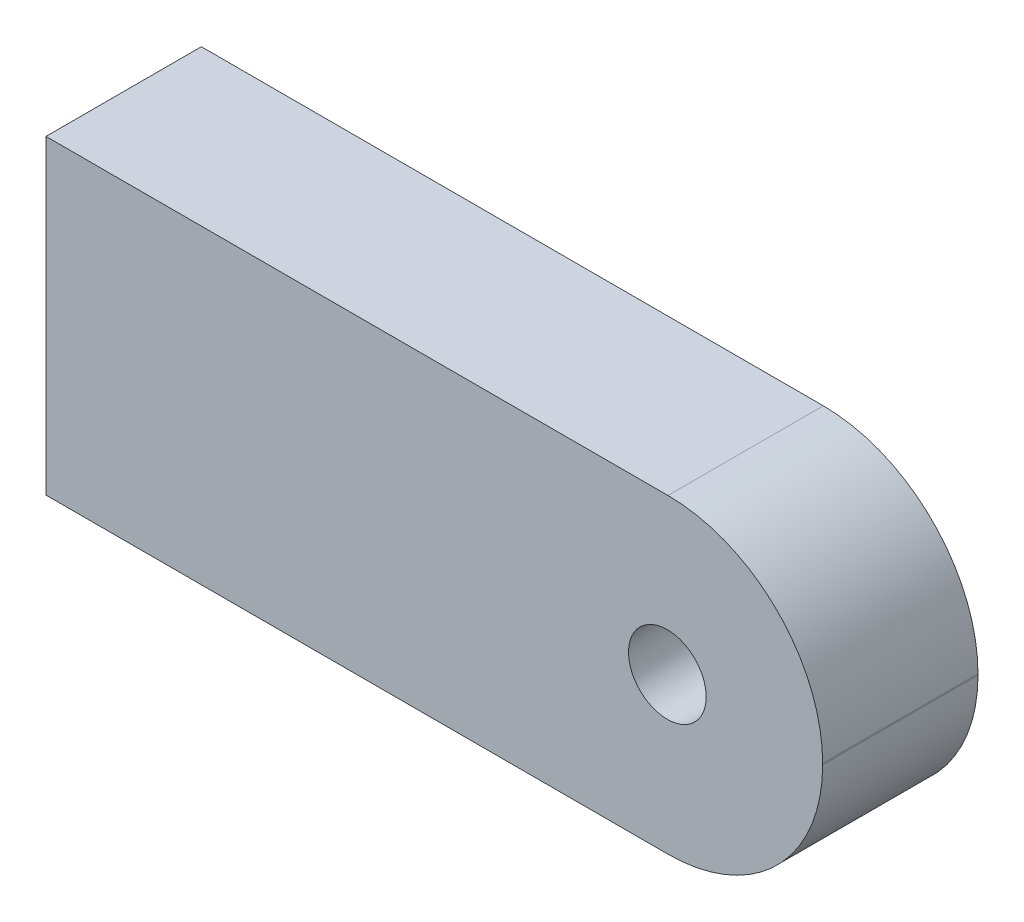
from build123d import *

# Parameters (mm, degrees)
SKETCH1_R           = 1.5875
BOSS_EXTRUDE1_DEPTH = 6.35


with BuildPart() as part:
    # Sketch1 → Boss-Extrude1 (new body)
    with BuildSketch(Plane.XY):
        with BuildLine():
            Line((-25.4, 6.35), (0.0254, 6.35))
            ThreePointArc((0.0254, 6.35), (4.497567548, 4.497567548), (6.35, 0.0254))
            Line((6.35, 0.0254), (6.35, -0.0254))
            ThreePointArc((6.35, -0.0254), (4.497567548, -4.497567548), (0.0254, -6.35))
            Line((0.0254, -6.35), (-25.4, -6.35))
            Line((-25.4, -6.35), (-25.4, 6.35))
        make_face()
        Circle(SKETCH1_R, mode=Mode.SUBTRACT)
    extrude(amount=BOSS_EXTRUDE1_DEPTH)


solid = part.part
